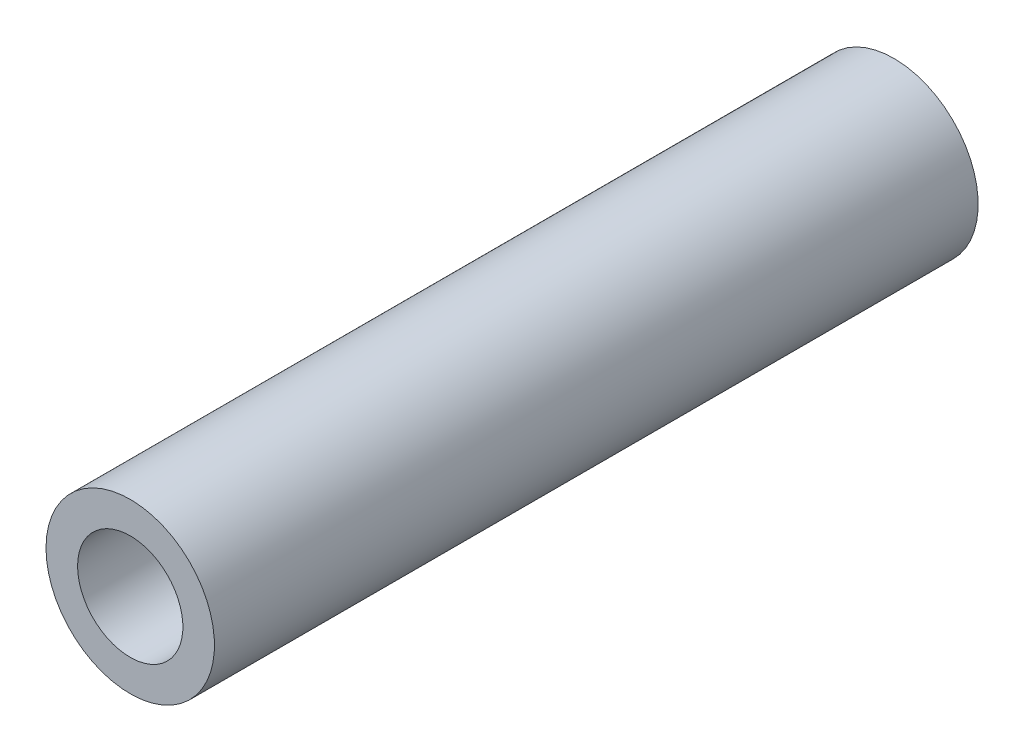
from build123d import *

# Parameters (mm, degrees)
ESQUISSE3_R          = 4
ESQUISSE3_R_2        = 2.5
BASE_EXTRUSION_DEPTH = 36.27


with BuildPart() as part:
    # Esquisse3 → Base-Extrusion (new body)
    with BuildSketch(Plane.XY):
        with Locations(Location((0, 0, 0), (0, 0, 180))):
            Circle(ESQUISSE3_R)
        with Locations(Location((0, 0, 0), (0, 0, 180))):
            Circle(ESQUISSE3_R_2, mode=Mode.SUBTRACT)
    extrude(amount=BASE_EXTRUSION_DEPTH)


solid = part.part
